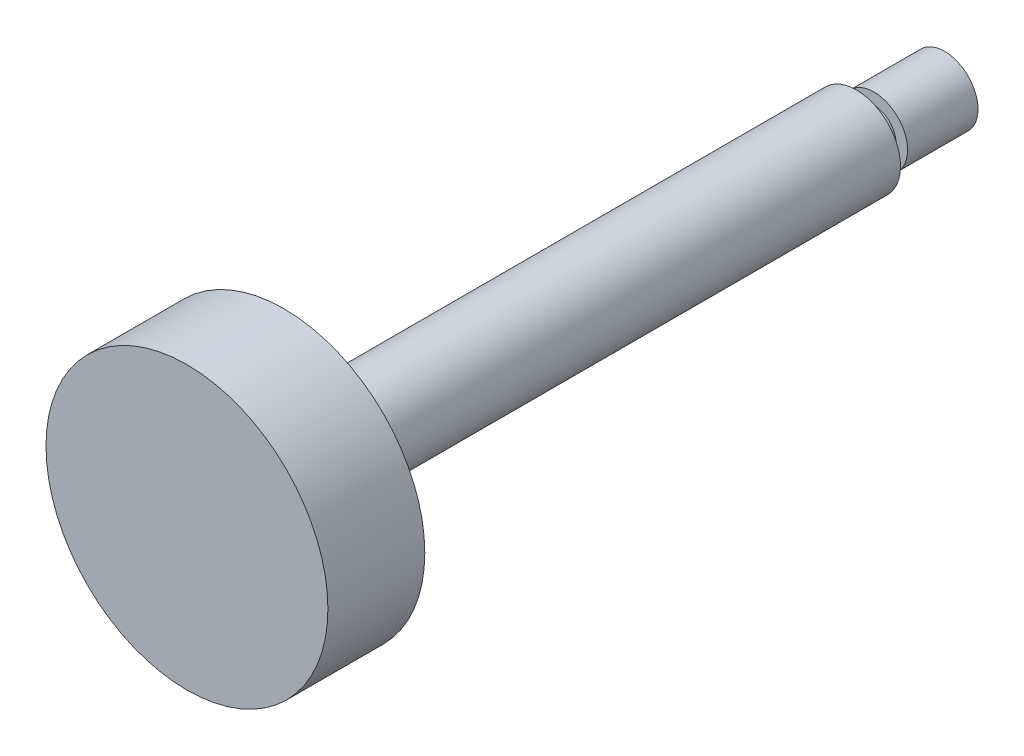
ISO-10303-21;
HEADER;
FILE_DESCRIPTION(('STEP AP214'),'2;1');
FILE_NAME('part.step','',(''),(''),'','','');
FILE_SCHEMA(('AUTOMOTIVE_DESIGN { 1 0 10303 214 1 1 1 1 }'));
ENDSEC;
DATA;
#1=APPLICATION_CONTEXT('core data for automotive mechanical design processes');
#2=APPLICATION_PROTOCOL_DEFINITION('international standard','automotive_design',2000,#1);
#3=PRODUCT_CONTEXT('',#1,'mechanical');
#4=PRODUCT('Part','Part','',(#3));
#5=PRODUCT_RELATED_PRODUCT_CATEGORY('part','',(#4));
#6=PRODUCT_DEFINITION_FORMATION('','',#4);
#7=PRODUCT_DEFINITION_CONTEXT('part definition',#1,'design');
#8=PRODUCT_DEFINITION('design','',#6,#7);
#9=PRODUCT_DEFINITION_SHAPE('','',#8);
#10=(LENGTH_UNIT() NAMED_UNIT(*) SI_UNIT(.MILLI.,.METRE.));
#11=(NAMED_UNIT(*) PLANE_ANGLE_UNIT() SI_UNIT($,.RADIAN.));
#12=(NAMED_UNIT(*) SI_UNIT($,.STERADIAN.) SOLID_ANGLE_UNIT());
#13=UNCERTAINTY_MEASURE_WITH_UNIT(LENGTH_MEASURE(1.E-05),#10,'distance_accuracy_value','');
#14=(GEOMETRIC_REPRESENTATION_CONTEXT(3) GLOBAL_UNCERTAINTY_ASSIGNED_CONTEXT((#13)) GLOBAL_UNIT_ASSIGNED_CONTEXT((#10,
#11,#12)) REPRESENTATION_CONTEXT('',''));
#15=CARTESIAN_POINT('',(0.,0.,0.));
#16=DIRECTION('',(0.,0.,1.));
#17=DIRECTION('',(1.,0.,0.));
#18=AXIS2_PLACEMENT_3D('',#15,#16,#17);
#19=CARTESIAN_POINT('',(0.,-5.,10.));
#20=DIRECTION('',(0.,0.,-1.));
#21=DIRECTION('',(0.,-1.,0.));
#22=AXIS2_PLACEMENT_3D('',#19,#20,#21);
#23=PLANE('',#22);
#24=CARTESIAN_POINT('',(0.,0.,10.));
#25=DIRECTION('',(0.,0.,1.));
#26=DIRECTION('',(0.,1.,0.));
#27=AXIS2_PLACEMENT_3D('',#24,#25,#26);
#28=CIRCLE('',#27,2.5);
#29=CARTESIAN_POINT('',(0.,2.5,10.));
#30=VERTEX_POINT('',#29);
#31=EDGE_CURVE('E40',#30,#30,#28,.T.);
#32=ORIENTED_EDGE('',*,*,#31,.T.);
#33=EDGE_LOOP('',(#32));
#34=FACE_BOUND('',#33,.T.);
#35=CARTESIAN_POINT('',(0.,0.,10.));
#36=DIRECTION('',(0.,0.,1.));
#37=DIRECTION('',(0.,1.,0.));
#38=AXIS2_PLACEMENT_3D('',#35,#36,#37);
#39=CIRCLE('',#38,5.);
#40=CARTESIAN_POINT('',(0.,5.,10.));
#41=VERTEX_POINT('',#40);
#42=EDGE_CURVE('E8',#41,#41,#39,.T.);
#43=ORIENTED_EDGE('',*,*,#42,.F.);
#44=EDGE_LOOP('',(#43));
#45=FACE_BOUND('',#44,.T.);
#46=ADVANCED_FACE('F12',(#34,#45),#23,.T.);
#47=CARTESIAN_POINT('',(0.,0.,20.));
#48=DIRECTION('',(0.,0.,1.));
#49=DIRECTION('',(0.,1.,0.));
#50=AXIS2_PLACEMENT_3D('',#47,#48,#49);
#51=CYLINDRICAL_SURFACE('',#50,5.);
#52=CARTESIAN_POINT('',(0.,0.,75.));
#53=DIRECTION('',(0.,0.,1.));
#54=DIRECTION('',(0.,1.,0.));
#55=AXIS2_PLACEMENT_3D('',#52,#53,#54);
#56=CIRCLE('',#55,5.);
#57=CARTESIAN_POINT('',(0.,5.,75.));
#58=VERTEX_POINT('',#57);
#59=EDGE_CURVE('E18',#58,#58,#56,.T.);
#60=ORIENTED_EDGE('',*,*,#59,.F.);
#61=EDGE_LOOP('',(#60));
#62=FACE_BOUND('',#61,.T.);
#63=ORIENTED_EDGE('',*,*,#42,.T.);
#64=EDGE_LOOP('',(#63));
#65=FACE_BOUND('',#64,.T.);
#66=ADVANCED_FACE('F59',(#62,#65),#51,.T.);
#67=CARTESIAN_POINT('',(0.,-16.,75.));
#68=DIRECTION('',(0.,0.,-1.));
#69=DIRECTION('',(0.,-1.,0.));
#70=AXIS2_PLACEMENT_3D('',#67,#68,#69);
#71=PLANE('',#70);
#72=ORIENTED_EDGE('',*,*,#59,.T.);
#73=EDGE_LOOP('',(#72));
#74=FACE_BOUND('',#73,.T.);
#75=CARTESIAN_POINT('',(0.,0.,75.));
#76=DIRECTION('',(0.,0.,1.));
#77=DIRECTION('',(0.,1.,0.));
#78=AXIS2_PLACEMENT_3D('',#75,#76,#77);
#79=CIRCLE('',#78,16.);
#80=CARTESIAN_POINT('',(0.,16.,75.));
#81=VERTEX_POINT('',#80);
#82=EDGE_CURVE('E22',#81,#81,#79,.T.);
#83=ORIENTED_EDGE('',*,*,#82,.F.);
#84=EDGE_LOOP('',(#83));
#85=FACE_BOUND('',#84,.T.);
#86=ADVANCED_FACE('F63',(#74,#85),#71,.T.);
#87=CARTESIAN_POINT('',(0.,0.,20.));
#88=DIRECTION('',(0.,0.,1.));
#89=DIRECTION('',(0.,1.,0.));
#90=AXIS2_PLACEMENT_3D('',#87,#88,#89);
#91=CYLINDRICAL_SURFACE('',#90,16.);
#92=CARTESIAN_POINT('',(0.,0.,86.));
#93=DIRECTION('',(0.,0.,1.));
#94=DIRECTION('',(0.,1.,0.));
#95=AXIS2_PLACEMENT_3D('',#92,#93,#94);
#96=CIRCLE('',#95,16.);
#97=CARTESIAN_POINT('',(0.,16.,86.));
#98=VERTEX_POINT('',#97);
#99=EDGE_CURVE('E26',#98,#98,#96,.T.);
#100=ORIENTED_EDGE('',*,*,#99,.F.);
#101=EDGE_LOOP('',(#100));
#102=FACE_BOUND('',#101,.T.);
#103=ORIENTED_EDGE('',*,*,#82,.T.);
#104=EDGE_LOOP('',(#103));
#105=FACE_BOUND('',#104,.T.);
#106=ADVANCED_FACE('F68',(#102,#105),#91,.T.);
#107=CARTESIAN_POINT('',(0.,-16.,86.));
#108=DIRECTION('',(0.,0.,-1.));
#109=DIRECTION('',(0.,-1.,0.));
#110=AXIS2_PLACEMENT_3D('',#107,#108,#109);
#111=PLANE('',#110);
#112=ORIENTED_EDGE('',*,*,#99,.T.);
#113=EDGE_LOOP('',(#112));
#114=FACE_BOUND('',#113,.T.);
#115=ADVANCED_FACE('F73',(#114),#111,.F.);
#116=CARTESIAN_POINT('',(0.,-3.8,0.));
#117=DIRECTION('',(0.,0.,-1.));
#118=DIRECTION('',(0.,-1.,0.));
#119=AXIS2_PLACEMENT_3D('',#116,#117,#118);
#120=PLANE('',#119);
#121=CARTESIAN_POINT('',(0.,0.,0.));
#122=DIRECTION('',(0.,0.,1.));
#123=DIRECTION('',(0.,1.,0.));
#124=AXIS2_PLACEMENT_3D('',#121,#122,#123);
#125=CIRCLE('',#124,3.8);
#126=CARTESIAN_POINT('',(0.,3.8,0.));
#127=VERTEX_POINT('',#126);
#128=EDGE_CURVE('E31',#127,#127,#125,.T.);
#129=ORIENTED_EDGE('',*,*,#128,.F.);
#130=EDGE_LOOP('',(#129));
#131=FACE_BOUND('',#130,.T.);
#132=ADVANCED_FACE('F77',(#131),#120,.T.);
#133=CARTESIAN_POINT('',(0.,0.,20.));
#134=DIRECTION('',(0.,0.,1.));
#135=DIRECTION('',(0.,1.,0.));
#136=AXIS2_PLACEMENT_3D('',#133,#134,#135);
#137=CYLINDRICAL_SURFACE('',#136,3.8);
#138=ORIENTED_EDGE('',*,*,#128,.T.);
#139=EDGE_LOOP('',(#138));
#140=FACE_BOUND('',#139,.T.);
#141=CARTESIAN_POINT('',(0.,0.,8.));
#142=DIRECTION('',(0.,0.,1.));
#143=DIRECTION('',(0.,1.,0.));
#144=AXIS2_PLACEMENT_3D('',#141,#142,#143);
#145=CIRCLE('',#144,3.8);
#146=CARTESIAN_POINT('',(0.,3.8,8.));
#147=VERTEX_POINT('',#146);
#148=EDGE_CURVE('E34',#147,#147,#145,.T.);
#149=ORIENTED_EDGE('',*,*,#148,.F.);
#150=EDGE_LOOP('',(#149));
#151=FACE_BOUND('',#150,.T.);
#152=ADVANCED_FACE('F55',(#140,#151),#137,.T.);
#153=CARTESIAN_POINT('',(0.,-2.5,8.));
#154=DIRECTION('',(0.,0.,1.));
#155=DIRECTION('',(0.,1.,0.));
#156=AXIS2_PLACEMENT_3D('',#153,#154,#155);
#157=PLANE('',#156);
#158=ORIENTED_EDGE('',*,*,#148,.T.);
#159=EDGE_LOOP('',(#158));
#160=FACE_BOUND('',#159,.T.);
#161=CARTESIAN_POINT('',(0.,0.,8.));
#162=DIRECTION('',(0.,0.,1.));
#163=DIRECTION('',(0.,1.,0.));
#164=AXIS2_PLACEMENT_3D('',#161,#162,#163);
#165=CIRCLE('',#164,2.5);
#166=CARTESIAN_POINT('',(0.,2.5,8.));
#167=VERTEX_POINT('',#166);
#168=EDGE_CURVE('E37',#167,#167,#165,.T.);
#169=ORIENTED_EDGE('',*,*,#168,.F.);
#170=EDGE_LOOP('',(#169));
#171=FACE_BOUND('',#170,.T.);
#172=ADVANCED_FACE('F48',(#160,#171),#157,.T.);
#173=CARTESIAN_POINT('',(0.,0.,20.));
#174=DIRECTION('',(0.,0.,1.));
#175=DIRECTION('',(0.,1.,0.));
#176=AXIS2_PLACEMENT_3D('',#173,#174,#175);
#177=CYLINDRICAL_SURFACE('',#176,2.5);
#178=ORIENTED_EDGE('',*,*,#168,.T.);
#179=EDGE_LOOP('',(#178));
#180=FACE_BOUND('',#179,.T.);
#181=ORIENTED_EDGE('',*,*,#31,.F.);
#182=EDGE_LOOP('',(#181));
#183=FACE_BOUND('',#182,.T.);
#184=ADVANCED_FACE('F46',(#180,#183),#177,.T.);
#185=CLOSED_SHELL('',(#46,#66,#86,#106,#115,#132,#152,#172,#184));
#186=MANIFOLD_SOLID_BREP('B1',#185);
#187=ADVANCED_BREP_SHAPE_REPRESENTATION('',(#18,#186),#14);
#188=SHAPE_DEFINITION_REPRESENTATION(#9,#187);
ENDSEC;
END-ISO-10303-21;
